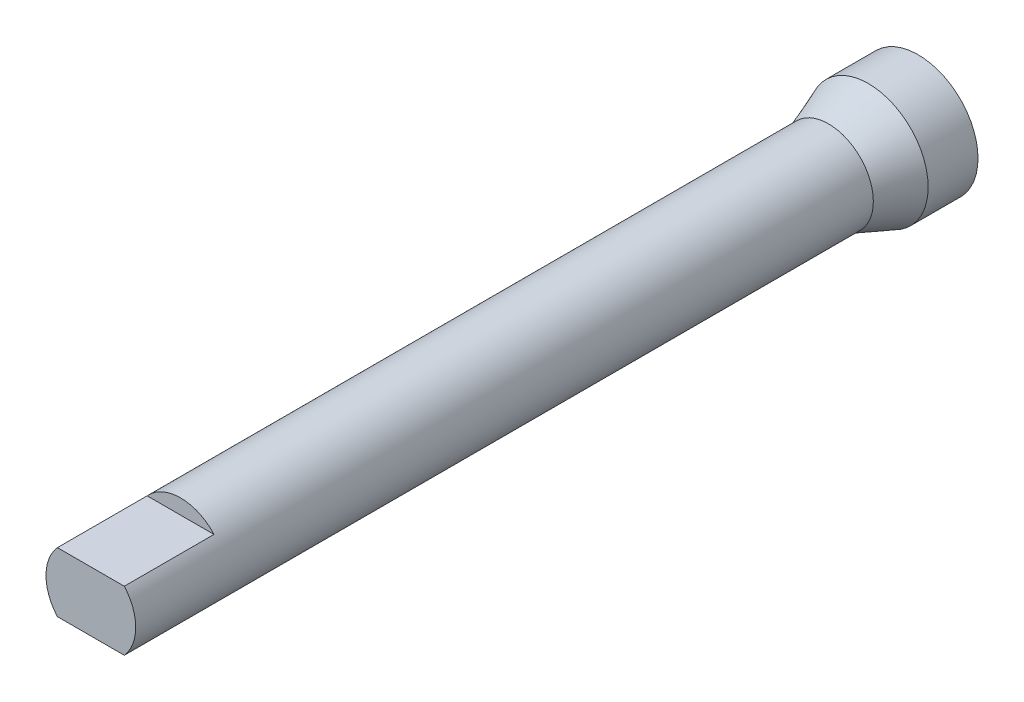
ISO-10303-21;
HEADER;
FILE_DESCRIPTION(('STEP AP214'),'2;1');
FILE_NAME('part.step','',(''),(''),'','','');
FILE_SCHEMA(('AUTOMOTIVE_DESIGN { 1 0 10303 214 1 1 1 1 }'));
ENDSEC;
DATA;
#1=APPLICATION_CONTEXT('core data for automotive mechanical design processes');
#2=APPLICATION_PROTOCOL_DEFINITION('international standard','automotive_design',2000,#1);
#3=PRODUCT_CONTEXT('',#1,'mechanical');
#4=PRODUCT('Part','Part','',(#3));
#5=PRODUCT_RELATED_PRODUCT_CATEGORY('part','',(#4));
#6=PRODUCT_DEFINITION_FORMATION('','',#4);
#7=PRODUCT_DEFINITION_CONTEXT('part definition',#1,'design');
#8=PRODUCT_DEFINITION('design','',#6,#7);
#9=PRODUCT_DEFINITION_SHAPE('','',#8);
#10=(LENGTH_UNIT() NAMED_UNIT(*) SI_UNIT(.MILLI.,.METRE.));
#11=(NAMED_UNIT(*) PLANE_ANGLE_UNIT() SI_UNIT($,.RADIAN.));
#12=(NAMED_UNIT(*) SI_UNIT($,.STERADIAN.) SOLID_ANGLE_UNIT());
#13=UNCERTAINTY_MEASURE_WITH_UNIT(LENGTH_MEASURE(1.E-05),#10,'distance_accuracy_value','');
#14=(GEOMETRIC_REPRESENTATION_CONTEXT(3) GLOBAL_UNCERTAINTY_ASSIGNED_CONTEXT((#13)) GLOBAL_UNIT_ASSIGNED_CONTEXT((#10,
#11,#12)) REPRESENTATION_CONTEXT('',''));
#15=CARTESIAN_POINT('',(0.,0.,0.));
#16=DIRECTION('',(0.,0.,1.));
#17=DIRECTION('',(1.,0.,0.));
#18=AXIS2_PLACEMENT_3D('',#15,#16,#17);
#19=CARTESIAN_POINT('',(-30.,0.,0.));
#20=DIRECTION('',(0.,0.,1.));
#21=DIRECTION('',(1.,0.,0.));
#22=AXIS2_PLACEMENT_3D('',#19,#20,#21);
#23=PLANE('',#22);
#24=CARTESIAN_POINT('',(0.,0.,0.));
#25=DIRECTION('',(0.,0.,1.));
#26=DIRECTION('',(1.,0.,0.));
#27=AXIS2_PLACEMENT_3D('',#24,#25,#26);
#28=CIRCLE('',#27,30.);
#29=CARTESIAN_POINT('',(30.,0.,0.));
#30=VERTEX_POINT('',#29);
#31=EDGE_CURVE('E112',#30,#30,#28,.T.);
#32=ORIENTED_EDGE('',*,*,#31,.F.);
#33=EDGE_LOOP('',(#32));
#34=FACE_BOUND('',#33,.T.);
#35=CARTESIAN_POINT('',(0.,0.,0.));
#36=DIRECTION('',(0.,0.,1.));
#37=DIRECTION('',(1.,0.,0.));
#38=AXIS2_PLACEMENT_3D('',#35,#36,#37);
#39=CIRCLE('',#38,25.);
#40=CARTESIAN_POINT('',(25.,0.,0.));
#41=VERTEX_POINT('',#40);
#42=EDGE_CURVE('E124',#41,#41,#39,.T.);
#43=ORIENTED_EDGE('',*,*,#42,.T.);
#44=EDGE_LOOP('',(#43));
#45=FACE_BOUND('',#44,.T.);
#46=ADVANCED_FACE('F36',(#34,#45),#23,.F.);
#47=CARTESIAN_POINT('',(0.,0.,47.25));
#48=DIRECTION('',(0.,0.,1.));
#49=DIRECTION('',(1.,0.,0.));
#50=AXIS2_PLACEMENT_3D('',#47,#48,#49);
#51=CYLINDRICAL_SURFACE('',#50,25.);
#52=ORIENTED_EDGE('',*,*,#42,.F.);
#53=EDGE_LOOP('',(#52));
#54=FACE_BOUND('',#53,.T.);
#55=CARTESIAN_POINT('',(0.,0.,25.));
#56=DIRECTION('',(0.,0.,1.));
#57=DIRECTION('',(1.,0.,0.));
#58=AXIS2_PLACEMENT_3D('',#55,#56,#57);
#59=CIRCLE('',#58,25.);
#60=CARTESIAN_POINT('',(25.,0.,25.));
#61=VERTEX_POINT('',#60);
#62=EDGE_CURVE('E121',#61,#61,#59,.T.);
#63=ORIENTED_EDGE('',*,*,#62,.T.);
#64=EDGE_LOOP('',(#63));
#65=FACE_BOUND('',#64,.T.);
#66=ADVANCED_FACE('F146',(#54,#65),#51,.F.);
#67=CARTESIAN_POINT('',(0.,0.,45.));
#68=DIRECTION('',(0.,0.,-1.));
#69=DIRECTION('',(-1.,0.,0.));
#70=AXIS2_PLACEMENT_3D('',#67,#68,#69);
#71=CONICAL_SURFACE('',#70,17.5,0.358770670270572);
#72=ORIENTED_EDGE('',*,*,#62,.F.);
#73=EDGE_LOOP('',(#72));
#74=FACE_BOUND('',#73,.T.);
#75=CARTESIAN_POINT('',(0.,0.,45.));
#76=DIRECTION('',(0.,0.,1.));
#77=DIRECTION('',(1.,0.,0.));
#78=AXIS2_PLACEMENT_3D('',#75,#76,#77);
#79=CIRCLE('',#78,17.5);
#80=CARTESIAN_POINT('',(17.5,0.,45.));
#81=VERTEX_POINT('',#80);
#82=EDGE_CURVE('E109',#81,#81,#79,.T.);
#83=ORIENTED_EDGE('',*,*,#82,.T.);
#84=EDGE_LOOP('',(#83));
#85=FACE_BOUND('',#84,.T.);
#86=ADVANCED_FACE('F151',(#74,#85),#71,.F.);
#87=CARTESIAN_POINT('',(0.,0.,25.));
#88=DIRECTION('',(0.,0.,-1.));
#89=DIRECTION('',(-1.,0.,0.));
#90=AXIS2_PLACEMENT_3D('',#87,#88,#89);
#91=CONICAL_SURFACE('',#90,30.,0.358770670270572);
#92=CARTESIAN_POINT('',(0.,0.,45.));
#93=DIRECTION('',(0.,0.,1.));
#94=DIRECTION('',(1.,0.,0.));
#95=AXIS2_PLACEMENT_3D('',#92,#93,#94);
#96=CIRCLE('',#95,22.5);
#97=CARTESIAN_POINT('',(22.5,0.,45.));
#98=VERTEX_POINT('',#97);
#99=EDGE_CURVE('E118',#98,#98,#96,.T.);
#100=ORIENTED_EDGE('',*,*,#99,.F.);
#101=EDGE_LOOP('',(#100));
#102=FACE_BOUND('',#101,.T.);
#103=CARTESIAN_POINT('',(0.,0.,25.));
#104=DIRECTION('',(0.,0.,1.));
#105=DIRECTION('',(1.,0.,0.));
#106=AXIS2_PLACEMENT_3D('',#103,#104,#105);
#107=CIRCLE('',#106,30.);
#108=CARTESIAN_POINT('',(30.,0.,25.));
#109=VERTEX_POINT('',#108);
#110=EDGE_CURVE('E115',#109,#109,#107,.T.);
#111=ORIENTED_EDGE('',*,*,#110,.T.);
#112=EDGE_LOOP('',(#111));
#113=FACE_BOUND('',#112,.T.);
#114=ADVANCED_FACE('F161',(#102,#113),#91,.T.);
#115=CARTESIAN_POINT('',(0.,0.,47.25));
#116=DIRECTION('',(0.,0.,1.));
#117=DIRECTION('',(1.,0.,0.));
#118=AXIS2_PLACEMENT_3D('',#115,#116,#117);
#119=CYLINDRICAL_SURFACE('',#118,30.);
#120=ORIENTED_EDGE('',*,*,#110,.F.);
#121=EDGE_LOOP('',(#120));
#122=FACE_BOUND('',#121,.T.);
#123=ORIENTED_EDGE('',*,*,#31,.T.);
#124=EDGE_LOOP('',(#123));
#125=FACE_BOUND('',#124,.T.);
#126=ADVANCED_FACE('F171',(#122,#125),#119,.T.);
#127=CARTESIAN_POINT('',(0.,0.,365.));
#128=DIRECTION('',(0.,0.,-1.));
#129=DIRECTION('',(-1.,0.,0.));
#130=AXIS2_PLACEMENT_3D('',#127,#128,#129);
#131=CYLINDRICAL_SURFACE('',#130,22.5);
#132=CARTESIAN_POINT('',(0.,0.,370.));
#133=DIRECTION('',(0.,0.,1.));
#134=DIRECTION('',(1.,0.,0.));
#135=AXIS2_PLACEMENT_3D('',#132,#133,#134);
#136=CIRCLE('',#135,22.5);
#137=CARTESIAN_POINT('',(16.7705098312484,15.,370.));
#138=VERTEX_POINT('',#137);
#139=CARTESIAN_POINT('',(-16.7705098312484,15.,370.));
#140=VERTEX_POINT('',#139);
#141=EDGE_CURVE('E11',#138,#140,#136,.T.);
#142=ORIENTED_EDGE('',*,*,#141,.F.);
#143=DIRECTION('',(0.,0.,1.));
#144=VECTOR('',#143,1.);
#145=CARTESIAN_POINT('',(16.7705098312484,15.,370.));
#146=LINE('',#145,#144);
#147=CARTESIAN_POINT('',(16.7705098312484,15.,415.));
#148=VERTEX_POINT('',#147);
#149=EDGE_CURVE('E82',#138,#148,#146,.T.);
#150=ORIENTED_EDGE('',*,*,#149,.T.);
#151=CARTESIAN_POINT('',(0.,0.,415.));
#152=DIRECTION('',(0.,0.,1.));
#153=DIRECTION('',(1.,0.,0.));
#154=AXIS2_PLACEMENT_3D('',#151,#152,#153);
#155=CIRCLE('',#154,22.5);
#156=CARTESIAN_POINT('',(16.7705098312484,-15.,415.));
#157=VERTEX_POINT('',#156);
#158=EDGE_CURVE('E92',#157,#148,#155,.T.);
#159=ORIENTED_EDGE('',*,*,#158,.F.);
#160=DIRECTION('',(0.,0.,1.));
#161=VECTOR('',#160,1.);
#162=CARTESIAN_POINT('',(16.7705098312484,-15.,370.));
#163=LINE('',#162,#161);
#164=CARTESIAN_POINT('',(16.7705098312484,-15.,370.));
#165=VERTEX_POINT('',#164);
#166=EDGE_CURVE('E50',#165,#157,#163,.T.);
#167=ORIENTED_EDGE('',*,*,#166,.F.);
#168=CARTESIAN_POINT('',(0.,0.,370.));
#169=DIRECTION('',(0.,0.,-1.));
#170=DIRECTION('',(-1.,0.,0.));
#171=AXIS2_PLACEMENT_3D('',#168,#169,#170);
#172=CIRCLE('',#171,22.5);
#173=CARTESIAN_POINT('',(-16.7705098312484,-15.,370.));
#174=VERTEX_POINT('',#173);
#175=EDGE_CURVE('E43',#165,#174,#172,.T.);
#176=ORIENTED_EDGE('',*,*,#175,.T.);
#177=DIRECTION('',(0.,0.,1.));
#178=VECTOR('',#177,1.);
#179=CARTESIAN_POINT('',(-16.7705098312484,-15.,370.));
#180=LINE('',#179,#178);
#181=CARTESIAN_POINT('',(-16.7705098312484,-15.,415.));
#182=VERTEX_POINT('',#181);
#183=EDGE_CURVE('E101',#174,#182,#180,.T.);
#184=ORIENTED_EDGE('',*,*,#183,.T.);
#185=CARTESIAN_POINT('',(-16.7705098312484,15.,415.));
#186=VERTEX_POINT('',#185);
#187=EDGE_CURVE('E90',#186,#182,#155,.T.);
#188=ORIENTED_EDGE('',*,*,#187,.F.);
#189=DIRECTION('',(0.,0.,1.));
#190=VECTOR('',#189,1.);
#191=CARTESIAN_POINT('',(-16.7705098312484,15.,370.));
#192=LINE('',#191,#190);
#193=EDGE_CURVE('E58',#140,#186,#192,.T.);
#194=ORIENTED_EDGE('',*,*,#193,.F.);
#195=EDGE_LOOP('',(#142,#150,#159,#167,#176,#184,#188,#194));
#196=FACE_BOUND('',#195,.T.);
#197=ORIENTED_EDGE('',*,*,#99,.T.);
#198=EDGE_LOOP('',(#197));
#199=FACE_BOUND('',#198,.T.);
#200=ADVANCED_FACE('F86',(#196,#199),#131,.T.);
#201=CARTESIAN_POINT('',(0.,0.,365.));
#202=DIRECTION('',(0.,0.,-1.));
#203=DIRECTION('',(-1.,0.,0.));
#204=AXIS2_PLACEMENT_3D('',#201,#202,#203);
#205=CYLINDRICAL_SURFACE('',#204,17.5);
#206=CARTESIAN_POINT('',(0.,0.,365.));
#207=DIRECTION('',(0.,0.,1.));
#208=DIRECTION('',(1.,0.,0.));
#209=AXIS2_PLACEMENT_3D('',#206,#207,#208);
#210=CIRCLE('',#209,17.5);
#211=CARTESIAN_POINT('',(17.5,0.,365.));
#212=VERTEX_POINT('',#211);
#213=EDGE_CURVE('E106',#212,#212,#210,.T.);
#214=ORIENTED_EDGE('',*,*,#213,.T.);
#215=EDGE_LOOP('',(#214));
#216=FACE_BOUND('',#215,.T.);
#217=ORIENTED_EDGE('',*,*,#82,.F.);
#218=EDGE_LOOP('',(#217));
#219=FACE_BOUND('',#218,.T.);
#220=ADVANCED_FACE('F141',(#216,#219),#205,.F.);
#221=CARTESIAN_POINT('',(0.,0.,365.));
#222=DIRECTION('',(0.,0.,1.));
#223=DIRECTION('',(1.,0.,0.));
#224=AXIS2_PLACEMENT_3D('',#221,#222,#223);
#225=PLANE('',#224);
#226=ORIENTED_EDGE('',*,*,#213,.F.);
#227=EDGE_LOOP('',(#226));
#228=FACE_BOUND('',#227,.T.);
#229=ADVANCED_FACE('F134',(#228),#225,.F.);
#230=CARTESIAN_POINT('',(0.,0.,415.));
#231=DIRECTION('',(0.,0.,1.));
#232=DIRECTION('',(1.,0.,0.));
#233=AXIS2_PLACEMENT_3D('',#230,#231,#232);
#234=PLANE('',#233);
#235=DIRECTION('',(1.,0.,0.));
#236=VECTOR('',#235,1.);
#237=CARTESIAN_POINT('',(16.7705098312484,15.,415.));
#238=LINE('',#237,#236);
#239=EDGE_CURVE('E83',#186,#148,#238,.T.);
#240=ORIENTED_EDGE('',*,*,#239,.F.);
#241=ORIENTED_EDGE('',*,*,#187,.T.);
#242=DIRECTION('',(-1.,0.,0.));
#243=VECTOR('',#242,1.);
#244=CARTESIAN_POINT('',(16.7705098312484,-15.,415.));
#245=LINE('',#244,#243);
#246=EDGE_CURVE('E99',#157,#182,#245,.T.);
#247=ORIENTED_EDGE('',*,*,#246,.F.);
#248=ORIENTED_EDGE('',*,*,#158,.T.);
#249=EDGE_LOOP('',(#240,#241,#247,#248));
#250=FACE_BOUND('',#249,.T.);
#251=ADVANCED_FACE('F132',(#250),#234,.T.);
#252=CARTESIAN_POINT('',(0.,0.,370.));
#253=DIRECTION('',(0.,0.,-1.));
#254=DIRECTION('',(-1.,0.,0.));
#255=AXIS2_PLACEMENT_3D('',#252,#253,#254);
#256=PLANE('',#255);
#257=DIRECTION('',(-1.,0.,0.));
#258=VECTOR('',#257,1.);
#259=CARTESIAN_POINT('',(16.7705098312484,-15.,370.));
#260=LINE('',#259,#258);
#261=EDGE_CURVE('E96',#165,#174,#260,.T.);
#262=ORIENTED_EDGE('',*,*,#261,.T.);
#263=ORIENTED_EDGE('',*,*,#175,.F.);
#264=EDGE_LOOP('',(#262,#263));
#265=FACE_BOUND('',#264,.T.);
#266=ADVANCED_FACE('F129',(#265),#256,.F.);
#267=CARTESIAN_POINT('',(16.7705098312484,-15.,370.));
#268=DIRECTION('',(0.,1.,0.));
#269=DIRECTION('',(-1.,0.,0.));
#270=AXIS2_PLACEMENT_3D('',#267,#268,#269);
#271=PLANE('',#270);
#272=ORIENTED_EDGE('',*,*,#246,.T.);
#273=ORIENTED_EDGE('',*,*,#183,.F.);
#274=ORIENTED_EDGE('',*,*,#261,.F.);
#275=ORIENTED_EDGE('',*,*,#166,.T.);
#276=EDGE_LOOP('',(#272,#273,#274,#275));
#277=FACE_BOUND('',#276,.T.);
#278=ADVANCED_FACE('F130',(#277),#271,.F.);
#279=CARTESIAN_POINT('',(0.,0.,370.));
#280=DIRECTION('',(0.,0.,1.));
#281=DIRECTION('',(1.,0.,0.));
#282=AXIS2_PLACEMENT_3D('',#279,#280,#281);
#283=PLANE('',#282);
#284=ORIENTED_EDGE('',*,*,#141,.T.);
#285=DIRECTION('',(1.,0.,0.));
#286=VECTOR('',#285,1.);
#287=CARTESIAN_POINT('',(16.7705098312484,15.,370.));
#288=LINE('',#287,#286);
#289=EDGE_CURVE('E78',#140,#138,#288,.T.);
#290=ORIENTED_EDGE('',*,*,#289,.T.);
#291=EDGE_LOOP('',(#284,#290));
#292=FACE_BOUND('',#291,.T.);
#293=ADVANCED_FACE('F77',(#292),#283,.T.);
#294=CARTESIAN_POINT('',(16.7705098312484,15.,370.));
#295=DIRECTION('',(0.,-1.,0.));
#296=DIRECTION('',(1.,0.,0.));
#297=AXIS2_PLACEMENT_3D('',#294,#295,#296);
#298=PLANE('',#297);
#299=ORIENTED_EDGE('',*,*,#239,.T.);
#300=ORIENTED_EDGE('',*,*,#149,.F.);
#301=ORIENTED_EDGE('',*,*,#289,.F.);
#302=ORIENTED_EDGE('',*,*,#193,.T.);
#303=EDGE_LOOP('',(#299,#300,#301,#302));
#304=FACE_BOUND('',#303,.T.);
#305=ADVANCED_FACE('F81',(#304),#298,.F.);
#306=CLOSED_SHELL('',(#46,#66,#86,#114,#126,#200,#220,#229,#251,#266,#278,#293,#305));
#307=MANIFOLD_SOLID_BREP('B2',#306);
#308=ADVANCED_BREP_SHAPE_REPRESENTATION('',(#18,#307),#14);
#309=SHAPE_DEFINITION_REPRESENTATION(#9,#308);
ENDSEC;
END-ISO-10303-21;
